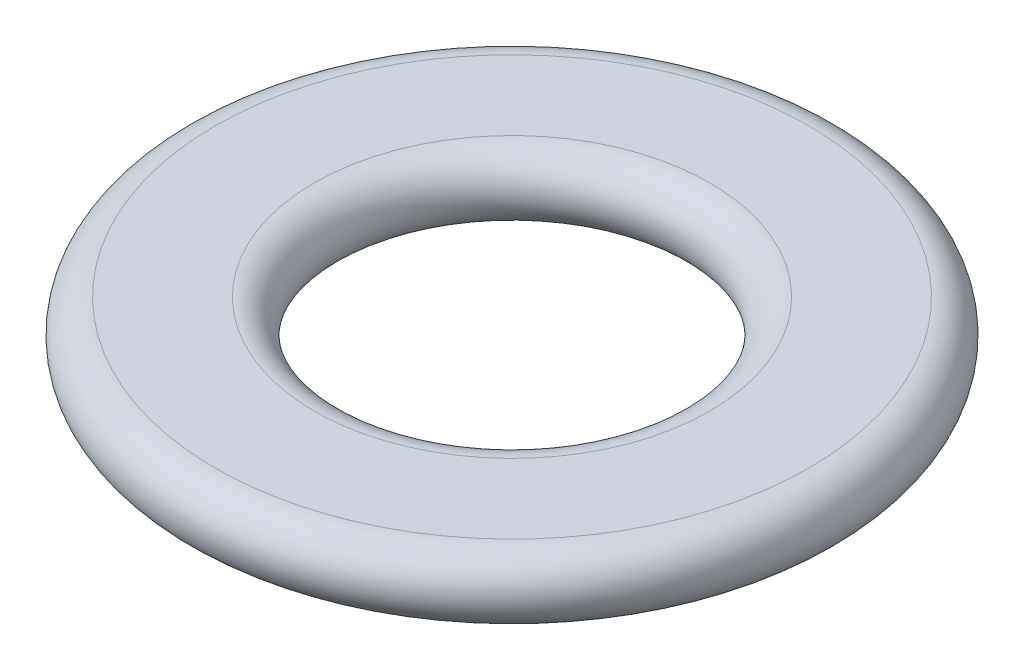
ISO-10303-21;
HEADER;
FILE_DESCRIPTION(('STEP AP214'),'2;1');
FILE_NAME('part.step','',(''),(''),'','','');
FILE_SCHEMA(('AUTOMOTIVE_DESIGN { 1 0 10303 214 1 1 1 1 }'));
ENDSEC;
DATA;
#1=APPLICATION_CONTEXT('core data for automotive mechanical design processes');
#2=APPLICATION_PROTOCOL_DEFINITION('international standard','automotive_design',2000,#1);
#3=PRODUCT_CONTEXT('',#1,'mechanical');
#4=PRODUCT('Part','Part','',(#3));
#5=PRODUCT_RELATED_PRODUCT_CATEGORY('part','',(#4));
#6=PRODUCT_DEFINITION_FORMATION('','',#4);
#7=PRODUCT_DEFINITION_CONTEXT('part definition',#1,'design');
#8=PRODUCT_DEFINITION('design','',#6,#7);
#9=PRODUCT_DEFINITION_SHAPE('','',#8);
#10=(LENGTH_UNIT() NAMED_UNIT(*) SI_UNIT(.MILLI.,.METRE.));
#11=(NAMED_UNIT(*) PLANE_ANGLE_UNIT() SI_UNIT($,.RADIAN.));
#12=(NAMED_UNIT(*) SI_UNIT($,.STERADIAN.) SOLID_ANGLE_UNIT());
#13=UNCERTAINTY_MEASURE_WITH_UNIT(LENGTH_MEASURE(1.E-05),#10,'distance_accuracy_value','');
#14=(GEOMETRIC_REPRESENTATION_CONTEXT(3) GLOBAL_UNCERTAINTY_ASSIGNED_CONTEXT((#13)) GLOBAL_UNIT_ASSIGNED_CONTEXT((#10,
#11,#12)) REPRESENTATION_CONTEXT('',''));
#15=CARTESIAN_POINT('',(0.,0.,0.));
#16=DIRECTION('',(0.,0.,1.));
#17=DIRECTION('',(1.,0.,0.));
#18=AXIS2_PLACEMENT_3D('',#15,#16,#17);
#19=CARTESIAN_POINT('',(0.,0.5,0.));
#20=DIRECTION('',(0.,1.,0.));
#21=DIRECTION('',(-1.,0.,0.));
#22=AXIS2_PLACEMENT_3D('',#19,#20,#21);
#23=TOROIDAL_SURFACE('',#22,3.,0.5);
#24=CARTESIAN_POINT('',(0.,0.,0.));
#25=DIRECTION('',(0.,1.,0.));
#26=DIRECTION('',(-1.,0.,0.));
#27=AXIS2_PLACEMENT_3D('',#24,#25,#26);
#28=CIRCLE('',#27,3.);
#29=CARTESIAN_POINT('',(-3.,0.,0.));
#30=VERTEX_POINT('',#29);
#31=EDGE_CURVE('E10',#30,#30,#28,.T.);
#32=ORIENTED_EDGE('',*,*,#31,.F.);
#33=EDGE_LOOP('',(#32));
#34=FACE_BOUND('',#33,.T.);
#35=CARTESIAN_POINT('',(0.,1.,0.));
#36=DIRECTION('',(0.,1.,0.));
#37=DIRECTION('',(-1.,0.,0.));
#38=AXIS2_PLACEMENT_3D('',#35,#36,#37);
#39=CIRCLE('',#38,3.);
#40=CARTESIAN_POINT('',(-3.,1.,0.));
#41=VERTEX_POINT('',#40);
#42=EDGE_CURVE('E42',#41,#41,#39,.T.);
#43=ORIENTED_EDGE('',*,*,#42,.T.);
#44=EDGE_LOOP('',(#43));
#45=FACE_BOUND('',#44,.T.);
#46=ADVANCED_FACE('F28',(#34,#45),#23,.T.);
#47=CARTESIAN_POINT('',(3.,0.,0.));
#48=DIRECTION('',(0.,1.,0.));
#49=DIRECTION('',(-1.,0.,0.));
#50=AXIS2_PLACEMENT_3D('',#47,#48,#49);
#51=PLANE('',#50);
#52=CARTESIAN_POINT('',(0.,0.,0.));
#53=DIRECTION('',(0.,1.,0.));
#54=DIRECTION('',(-1.,0.,0.));
#55=AXIS2_PLACEMENT_3D('',#52,#53,#54);
#56=CIRCLE('',#55,4.5);
#57=CARTESIAN_POINT('',(-4.5,0.,0.));
#58=VERTEX_POINT('',#57);
#59=EDGE_CURVE('E34',#58,#58,#56,.T.);
#60=ORIENTED_EDGE('',*,*,#59,.F.);
#61=EDGE_LOOP('',(#60));
#62=FACE_BOUND('',#61,.T.);
#63=ORIENTED_EDGE('',*,*,#31,.T.);
#64=EDGE_LOOP('',(#63));
#65=FACE_BOUND('',#64,.T.);
#66=ADVANCED_FACE('F57',(#62,#65),#51,.F.);
#67=CARTESIAN_POINT('',(0.,0.500000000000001,0.));
#68=DIRECTION('',(0.,1.,0.));
#69=DIRECTION('',(-1.,0.,0.));
#70=AXIS2_PLACEMENT_3D('',#67,#68,#69);
#71=TOROIDAL_SURFACE('',#70,4.5,0.5);
#72=CARTESIAN_POINT('',(0.,1.,0.));
#73=DIRECTION('',(0.,1.,0.));
#74=DIRECTION('',(-1.,0.,0.));
#75=AXIS2_PLACEMENT_3D('',#72,#73,#74);
#76=CIRCLE('',#75,4.5);
#77=CARTESIAN_POINT('',(-4.5,1.,0.));
#78=VERTEX_POINT('',#77);
#79=EDGE_CURVE('E38',#78,#78,#76,.T.);
#80=ORIENTED_EDGE('',*,*,#79,.F.);
#81=EDGE_LOOP('',(#80));
#82=FACE_BOUND('',#81,.T.);
#83=ORIENTED_EDGE('',*,*,#59,.T.);
#84=EDGE_LOOP('',(#83));
#85=FACE_BOUND('',#84,.T.);
#86=ADVANCED_FACE('F52',(#82,#85),#71,.T.);
#87=CARTESIAN_POINT('',(3.,1.,0.));
#88=DIRECTION('',(0.,-1.,0.));
#89=DIRECTION('',(1.,0.,0.));
#90=AXIS2_PLACEMENT_3D('',#87,#88,#89);
#91=PLANE('',#90);
#92=ORIENTED_EDGE('',*,*,#42,.F.);
#93=EDGE_LOOP('',(#92));
#94=FACE_BOUND('',#93,.T.);
#95=ORIENTED_EDGE('',*,*,#79,.T.);
#96=EDGE_LOOP('',(#95));
#97=FACE_BOUND('',#96,.T.);
#98=ADVANCED_FACE('F49',(#94,#97),#91,.F.);
#99=CLOSED_SHELL('',(#46,#66,#86,#98));
#100=MANIFOLD_SOLID_BREP('B2',#99);
#101=ADVANCED_BREP_SHAPE_REPRESENTATION('',(#18,#100),#14);
#102=SHAPE_DEFINITION_REPRESENTATION(#9,#101);
ENDSEC;
END-ISO-10303-21;
